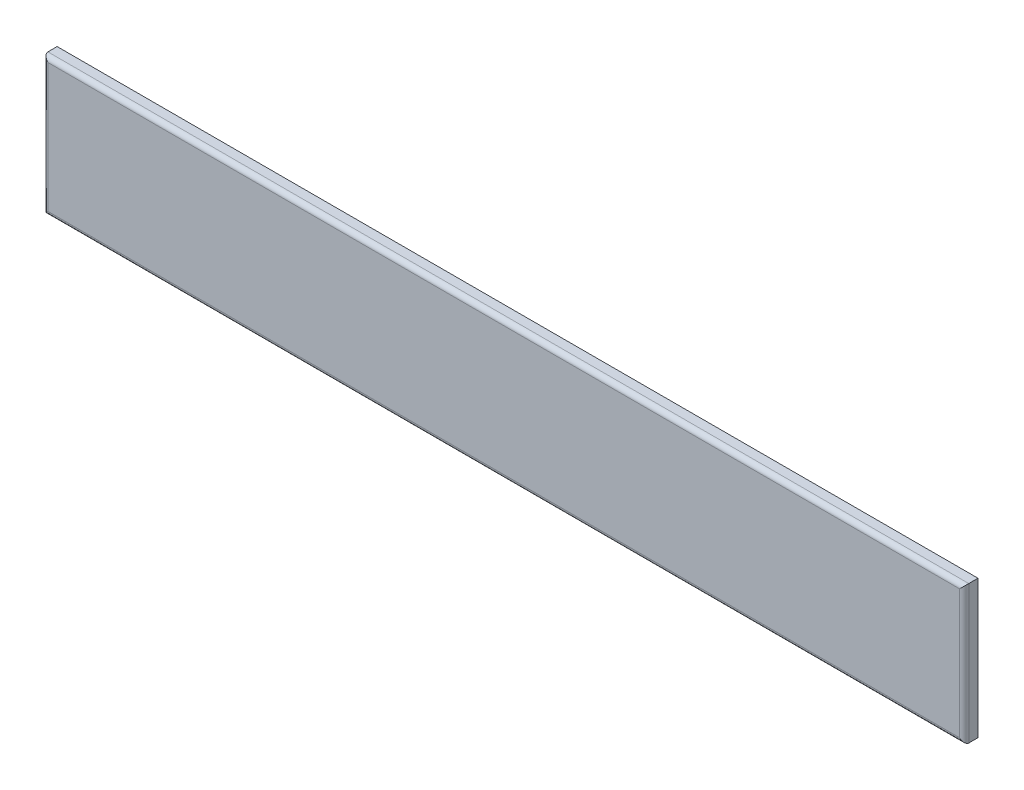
ISO-10303-21;
HEADER;
FILE_DESCRIPTION(('STEP AP214'),'2;1');
FILE_NAME('part.step','',(''),(''),'','','');
FILE_SCHEMA(('AUTOMOTIVE_DESIGN { 1 0 10303 214 1 1 1 1 }'));
ENDSEC;
DATA;
#1=APPLICATION_CONTEXT('core data for automotive mechanical design processes');
#2=APPLICATION_PROTOCOL_DEFINITION('international standard','automotive_design',2000,#1);
#3=PRODUCT_CONTEXT('',#1,'mechanical');
#4=PRODUCT('Part','Part','',(#3));
#5=PRODUCT_RELATED_PRODUCT_CATEGORY('part','',(#4));
#6=PRODUCT_DEFINITION_FORMATION('','',#4);
#7=PRODUCT_DEFINITION_CONTEXT('part definition',#1,'design');
#8=PRODUCT_DEFINITION('design','',#6,#7);
#9=PRODUCT_DEFINITION_SHAPE('','',#8);
#10=(LENGTH_UNIT() NAMED_UNIT(*) SI_UNIT(.MILLI.,.METRE.));
#11=(NAMED_UNIT(*) PLANE_ANGLE_UNIT() SI_UNIT($,.RADIAN.));
#12=(NAMED_UNIT(*) SI_UNIT($,.STERADIAN.) SOLID_ANGLE_UNIT());
#13=UNCERTAINTY_MEASURE_WITH_UNIT(LENGTH_MEASURE(1.E-05),#10,'distance_accuracy_value','');
#14=(GEOMETRIC_REPRESENTATION_CONTEXT(3) GLOBAL_UNCERTAINTY_ASSIGNED_CONTEXT((#13)) GLOBAL_UNIT_ASSIGNED_CONTEXT((#10,
#11,#12)) REPRESENTATION_CONTEXT('',''));
#15=CARTESIAN_POINT('',(0.,0.,0.));
#16=DIRECTION('',(0.,0.,1.));
#17=DIRECTION('',(1.,0.,0.));
#18=AXIS2_PLACEMENT_3D('',#15,#16,#17);
#19=CARTESIAN_POINT('',(0.,0.,30.));
#20=DIRECTION('',(-1.,0.,0.));
#21=DIRECTION('',(0.,-1.,0.));
#22=AXIS2_PLACEMENT_3D('',#19,#20,#21);
#23=PLANE('',#22);
#24=DIRECTION('',(0.,0.,-1.));
#25=VECTOR('',#24,1.);
#26=CARTESIAN_POINT('',(0.,0.,30.));
#27=LINE('',#26,#25);
#28=CARTESIAN_POINT('',(0.,0.,20.));
#29=VERTEX_POINT('',#28);
#30=CARTESIAN_POINT('',(0.,0.,0.));
#31=VERTEX_POINT('',#30);
#32=EDGE_CURVE('E90',#29,#31,#27,.T.);
#33=ORIENTED_EDGE('',*,*,#32,.F.);
#34=DIRECTION('',(0.,1.,0.));
#35=VECTOR('',#34,1.);
#36=CARTESIAN_POINT('',(0.,0.,20.));
#37=LINE('',#36,#35);
#38=CARTESIAN_POINT('',(0.,-300.,20.));
#39=VERTEX_POINT('',#38);
#40=EDGE_CURVE('E11',#29,#39,#37,.F.);
#41=ORIENTED_EDGE('',*,*,#40,.T.);
#42=DIRECTION('',(0.,0.,-1.));
#43=VECTOR('',#42,1.);
#44=CARTESIAN_POINT('',(0.,-300.,30.));
#45=LINE('',#44,#43);
#46=CARTESIAN_POINT('',(0.,-300.,0.));
#47=VERTEX_POINT('',#46);
#48=EDGE_CURVE('E110',#39,#47,#45,.T.);
#49=ORIENTED_EDGE('',*,*,#48,.T.);
#50=DIRECTION('',(0.,1.,0.));
#51=VECTOR('',#50,1.);
#52=CARTESIAN_POINT('',(0.,0.,0.));
#53=LINE('',#52,#51);
#54=EDGE_CURVE('E105',#47,#31,#53,.T.);
#55=ORIENTED_EDGE('',*,*,#54,.T.);
#56=EDGE_LOOP('',(#33,#41,#49,#55));
#57=FACE_BOUND('',#56,.T.);
#58=ADVANCED_FACE('F38',(#57),#23,.F.);
#59=CARTESIAN_POINT('',(0.,0.,30.));
#60=DIRECTION('',(0.,-1.,0.));
#61=DIRECTION('',(0.,0.,-1.));
#62=AXIS2_PLACEMENT_3D('',#59,#60,#61);
#63=PLANE('',#62);
#64=DIRECTION('',(0.,0.,-1.));
#65=VECTOR('',#64,1.);
#66=CARTESIAN_POINT('',(-2000.,0.,30.));
#67=LINE('',#66,#65);
#68=CARTESIAN_POINT('',(-2000.,0.,20.));
#69=VERTEX_POINT('',#68);
#70=CARTESIAN_POINT('',(-2000.,0.,0.));
#71=VERTEX_POINT('',#70);
#72=EDGE_CURVE('E99',#69,#71,#67,.T.);
#73=ORIENTED_EDGE('',*,*,#72,.F.);
#74=DIRECTION('',(-1.,0.,0.));
#75=VECTOR('',#74,1.);
#76=CARTESIAN_POINT('',(0.,0.,20.));
#77=LINE('',#76,#75);
#78=EDGE_CURVE('E47',#69,#29,#77,.F.);
#79=ORIENTED_EDGE('',*,*,#78,.T.);
#80=ORIENTED_EDGE('',*,*,#32,.T.);
#81=DIRECTION('',(-1.,0.,0.));
#82=VECTOR('',#81,1.);
#83=CARTESIAN_POINT('',(0.,0.,0.));
#84=LINE('',#83,#82);
#85=EDGE_CURVE('E93',#31,#71,#84,.T.);
#86=ORIENTED_EDGE('',*,*,#85,.T.);
#87=EDGE_LOOP('',(#73,#79,#80,#86));
#88=FACE_BOUND('',#87,.T.);
#89=ADVANCED_FACE('F92',(#88),#63,.F.);
#90=CARTESIAN_POINT('',(-2000.,0.,30.));
#91=DIRECTION('',(1.,0.,0.));
#92=DIRECTION('',(0.,1.,0.));
#93=AXIS2_PLACEMENT_3D('',#90,#91,#92);
#94=PLANE('',#93);
#95=DIRECTION('',(0.,0.,-1.));
#96=VECTOR('',#95,1.);
#97=CARTESIAN_POINT('',(-2000.,-300.,30.));
#98=LINE('',#97,#96);
#99=CARTESIAN_POINT('',(-2000.,-300.,20.));
#100=VERTEX_POINT('',#99);
#101=CARTESIAN_POINT('',(-2000.,-300.,0.));
#102=VERTEX_POINT('',#101);
#103=EDGE_CURVE('E120',#100,#102,#98,.T.);
#104=ORIENTED_EDGE('',*,*,#103,.F.);
#105=DIRECTION('',(0.,-1.,0.));
#106=VECTOR('',#105,1.);
#107=CARTESIAN_POINT('',(-2000.,0.,20.));
#108=LINE('',#107,#106);
#109=EDGE_CURVE('E62',#100,#69,#108,.F.);
#110=ORIENTED_EDGE('',*,*,#109,.T.);
#111=ORIENTED_EDGE('',*,*,#72,.T.);
#112=DIRECTION('',(0.,-1.,0.));
#113=VECTOR('',#112,1.);
#114=CARTESIAN_POINT('',(-2000.,0.,0.));
#115=LINE('',#114,#113);
#116=EDGE_CURVE('E107',#71,#102,#115,.T.);
#117=ORIENTED_EDGE('',*,*,#116,.T.);
#118=EDGE_LOOP('',(#104,#110,#111,#117));
#119=FACE_BOUND('',#118,.T.);
#120=ADVANCED_FACE('F158',(#119),#94,.F.);
#121=CARTESIAN_POINT('',(0.,-300.,30.));
#122=DIRECTION('',(0.,1.,0.));
#123=DIRECTION('',(-1.,0.,0.));
#124=AXIS2_PLACEMENT_3D('',#121,#122,#123);
#125=PLANE('',#124);
#126=ORIENTED_EDGE('',*,*,#48,.F.);
#127=DIRECTION('',(1.,0.,0.));
#128=VECTOR('',#127,1.);
#129=CARTESIAN_POINT('',(0.,-300.,20.));
#130=LINE('',#129,#128);
#131=EDGE_CURVE('E131',#39,#100,#130,.F.);
#132=ORIENTED_EDGE('',*,*,#131,.T.);
#133=ORIENTED_EDGE('',*,*,#103,.T.);
#134=DIRECTION('',(1.,0.,0.));
#135=VECTOR('',#134,1.);
#136=CARTESIAN_POINT('',(0.,-300.,0.));
#137=LINE('',#136,#135);
#138=EDGE_CURVE('E117',#102,#47,#137,.T.);
#139=ORIENTED_EDGE('',*,*,#138,.T.);
#140=EDGE_LOOP('',(#126,#132,#133,#139));
#141=FACE_BOUND('',#140,.T.);
#142=ADVANCED_FACE('F157',(#141),#125,.F.);
#143=CARTESIAN_POINT('',(0.,0.,30.));
#144=DIRECTION('',(0.,0.,-1.));
#145=DIRECTION('',(-1.,0.,0.));
#146=AXIS2_PLACEMENT_3D('',#143,#144,#145);
#147=PLANE('',#146);
#148=DIRECTION('',(0.,-1.,0.));
#149=VECTOR('',#148,1.);
#150=CARTESIAN_POINT('',(-1990.,-1.47289587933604E-12,30.));
#151=LINE('',#150,#149);
#152=CARTESIAN_POINT('',(-1990.,-10.,30.));
#153=VERTEX_POINT('',#152);
#154=CARTESIAN_POINT('',(-1990.,-290.,30.));
#155=VERTEX_POINT('',#154);
#156=EDGE_CURVE('E126',#153,#155,#151,.T.);
#157=ORIENTED_EDGE('',*,*,#156,.T.);
#158=DIRECTION('',(1.,0.,0.));
#159=VECTOR('',#158,1.);
#160=CARTESIAN_POINT('',(0.,-290.,30.));
#161=LINE('',#160,#159);
#162=CARTESIAN_POINT('',(-9.99999999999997,-290.,30.));
#163=VERTEX_POINT('',#162);
#164=EDGE_CURVE('E128',#155,#163,#161,.T.);
#165=ORIENTED_EDGE('',*,*,#164,.T.);
#166=DIRECTION('',(0.,1.,0.));
#167=VECTOR('',#166,1.);
#168=CARTESIAN_POINT('',(-10.,0.,30.));
#169=LINE('',#168,#167);
#170=CARTESIAN_POINT('',(-10.,-10.,30.));
#171=VERTEX_POINT('',#170);
#172=EDGE_CURVE('E98',#163,#171,#169,.T.);
#173=ORIENTED_EDGE('',*,*,#172,.T.);
#174=DIRECTION('',(-1.,0.,0.));
#175=VECTOR('',#174,1.);
#176=CARTESIAN_POINT('',(0.,-10.,30.));
#177=LINE('',#176,#175);
#178=EDGE_CURVE('E124',#171,#153,#177,.T.);
#179=ORIENTED_EDGE('',*,*,#178,.T.);
#180=EDGE_LOOP('',(#157,#165,#173,#179));
#181=FACE_BOUND('',#180,.T.);
#182=ADVANCED_FACE('F150',(#181),#147,.F.);
#183=CARTESIAN_POINT('',(0.,0.,0.));
#184=DIRECTION('',(0.,0.,-1.));
#185=DIRECTION('',(-1.,0.,0.));
#186=AXIS2_PLACEMENT_3D('',#183,#184,#185);
#187=PLANE('',#186);
#188=ORIENTED_EDGE('',*,*,#54,.F.);
#189=ORIENTED_EDGE('',*,*,#138,.F.);
#190=ORIENTED_EDGE('',*,*,#116,.F.);
#191=ORIENTED_EDGE('',*,*,#85,.F.);
#192=EDGE_LOOP('',(#188,#189,#190,#191));
#193=FACE_BOUND('',#192,.T.);
#194=ADVANCED_FACE('F103',(#193),#187,.T.);
#195=CARTESIAN_POINT('',(0.,-10.,20.));
#196=DIRECTION('',(-1.,0.,0.));
#197=DIRECTION('',(0.,0.,1.));
#198=AXIS2_PLACEMENT_3D('',#195,#196,#197);
#199=CYLINDRICAL_SURFACE('',#198,10.);
#200=CARTESIAN_POINT('',(-10.,-10.,20.));
#201=DIRECTION('',(-0.707106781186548,0.707106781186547,0.));
#202=DIRECTION('',(0.707106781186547,0.707106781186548,0.));
#203=AXIS2_PLACEMENT_3D('',#200,#201,#202);
#204=ELLIPSE('',#203,14.1421356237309,10.);
#205=EDGE_CURVE('E114',#29,#171,#204,.F.);
#206=ORIENTED_EDGE('',*,*,#205,.F.);
#207=ORIENTED_EDGE('',*,*,#78,.F.);
#208=CARTESIAN_POINT('',(-1990.,-10.,20.));
#209=DIRECTION('',(-0.707106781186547,-0.707106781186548,0.));
#210=DIRECTION('',(-0.707106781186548,0.707106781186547,0.));
#211=AXIS2_PLACEMENT_3D('',#208,#209,#210);
#212=ELLIPSE('',#211,14.142135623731,10.);
#213=EDGE_CURVE('E42',#153,#69,#212,.T.);
#214=ORIENTED_EDGE('',*,*,#213,.F.);
#215=ORIENTED_EDGE('',*,*,#178,.F.);
#216=EDGE_LOOP('',(#206,#207,#214,#215));
#217=FACE_BOUND('',#216,.T.);
#218=ADVANCED_FACE('F40',(#217),#199,.T.);
#219=CARTESIAN_POINT('',(-1990.,-1.47289587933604E-12,20.));
#220=DIRECTION('',(0.,-1.,0.));
#221=DIRECTION('',(1.,0.,0.));
#222=AXIS2_PLACEMENT_3D('',#219,#220,#221);
#223=CYLINDRICAL_SURFACE('',#222,10.);
#224=ORIENTED_EDGE('',*,*,#213,.T.);
#225=ORIENTED_EDGE('',*,*,#109,.F.);
#226=CARTESIAN_POINT('',(-1990.,-290.,20.));
#227=DIRECTION('',(0.707106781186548,-0.707106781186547,0.));
#228=DIRECTION('',(-0.707106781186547,-0.707106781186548,0.));
#229=AXIS2_PLACEMENT_3D('',#226,#227,#228);
#230=ELLIPSE('',#229,14.1421356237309,10.);
#231=EDGE_CURVE('E138',#155,#100,#230,.T.);
#232=ORIENTED_EDGE('',*,*,#231,.F.);
#233=ORIENTED_EDGE('',*,*,#156,.F.);
#234=EDGE_LOOP('',(#224,#225,#232,#233));
#235=FACE_BOUND('',#234,.T.);
#236=ADVANCED_FACE('F175',(#235),#223,.T.);
#237=CARTESIAN_POINT('',(-10.,0.,20.));
#238=DIRECTION('',(0.,1.,0.));
#239=DIRECTION('',(-1.,0.,0.));
#240=AXIS2_PLACEMENT_3D('',#237,#238,#239);
#241=CYLINDRICAL_SURFACE('',#240,10.);
#242=ORIENTED_EDGE('',*,*,#205,.T.);
#243=ORIENTED_EDGE('',*,*,#172,.F.);
#244=CARTESIAN_POINT('',(-9.99999999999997,-290.,20.));
#245=DIRECTION('',(0.707106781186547,0.707106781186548,0.));
#246=DIRECTION('',(-0.707106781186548,0.707106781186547,0.));
#247=AXIS2_PLACEMENT_3D('',#244,#245,#246);
#248=ELLIPSE('',#247,14.1421356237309,10.);
#249=EDGE_CURVE('E136',#39,#163,#248,.F.);
#250=ORIENTED_EDGE('',*,*,#249,.F.);
#251=ORIENTED_EDGE('',*,*,#40,.F.);
#252=EDGE_LOOP('',(#242,#243,#250,#251));
#253=FACE_BOUND('',#252,.T.);
#254=ADVANCED_FACE('F143',(#253),#241,.T.);
#255=CARTESIAN_POINT('',(0.,-290.,20.));
#256=DIRECTION('',(1.,0.,0.));
#257=DIRECTION('',(0.,1.,0.));
#258=AXIS2_PLACEMENT_3D('',#255,#256,#257);
#259=CYLINDRICAL_SURFACE('',#258,10.);
#260=ORIENTED_EDGE('',*,*,#231,.T.);
#261=ORIENTED_EDGE('',*,*,#131,.F.);
#262=ORIENTED_EDGE('',*,*,#249,.T.);
#263=ORIENTED_EDGE('',*,*,#164,.F.);
#264=EDGE_LOOP('',(#260,#261,#262,#263));
#265=FACE_BOUND('',#264,.T.);
#266=ADVANCED_FACE('F154',(#265),#259,.T.);
#267=CLOSED_SHELL('',(#58,#89,#120,#142,#182,#194,#218,#236,#254,#266));
#268=MANIFOLD_SOLID_BREP('B2',#267);
#269=ADVANCED_BREP_SHAPE_REPRESENTATION('',(#18,#268),#14);
#270=SHAPE_DEFINITION_REPRESENTATION(#9,#269);
ENDSEC;
END-ISO-10303-21;
